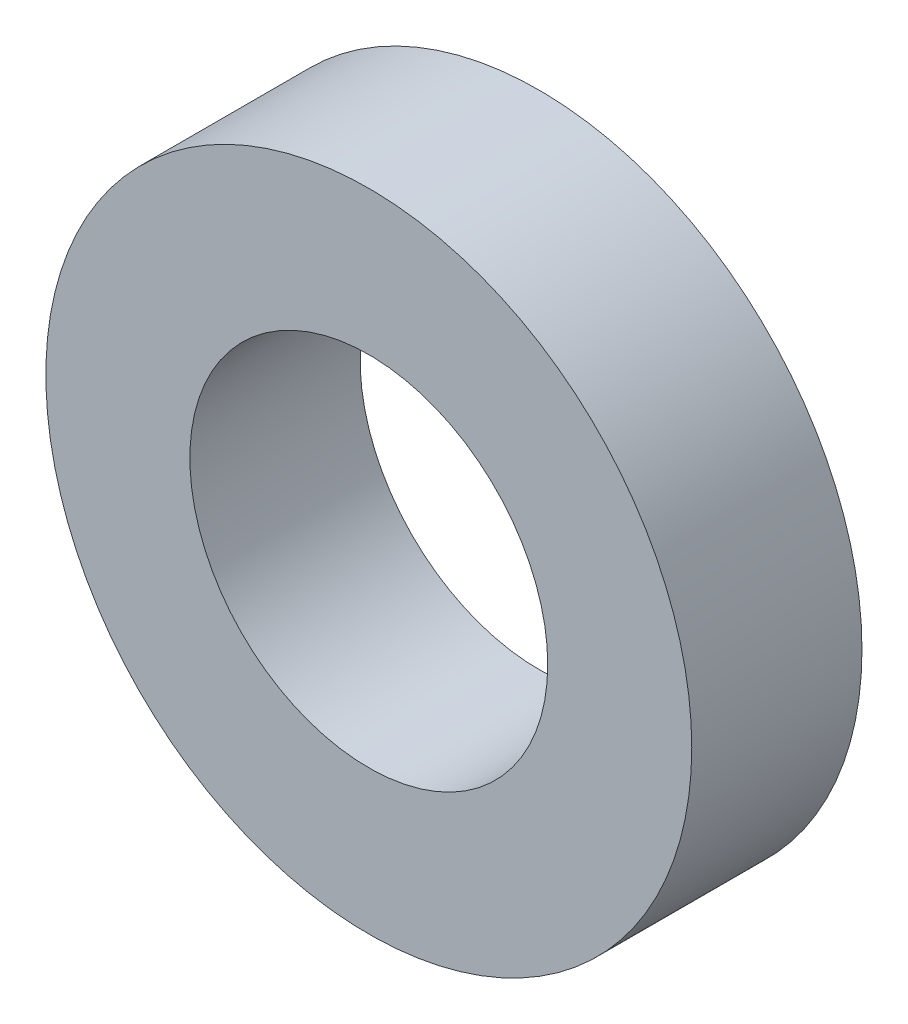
from build123d import *

# Parameters (mm, degrees)
ESQUISSE1_W = 3.9
ESQUISSE1_H = 3.3


with BuildPart() as part:
    # Esquisse1 → R_volution2 (revolve)
    with BuildSketch(Plane(origin=(0, 0, 0), x_dir=(0, 0, -1), z_dir=(1, 0, 0)), mode=Mode.PRIVATE) as r_volution2_sk:
        with Locations((1.95, 5.75)):
            Rectangle(ESQUISSE1_W, ESQUISSE1_H)
    revolve(r_volution2_sk.sketch.rotate(Axis((0, 0, 0), (0, 0, -1)), 90), axis=Axis((0, 0, 0), (0, 0, -1)))


solid = part.part
